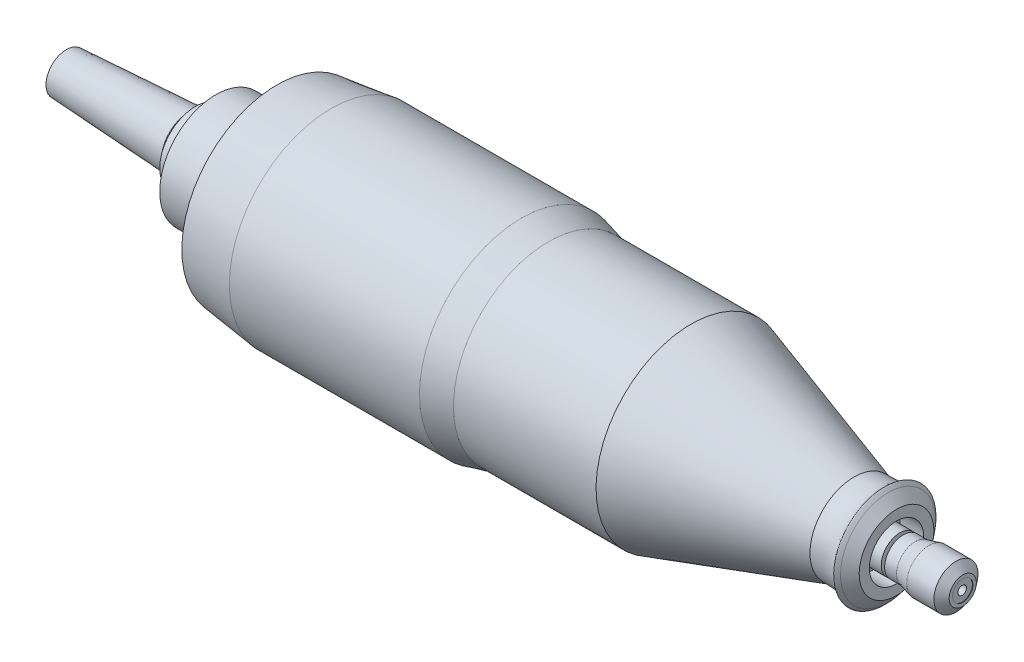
from build123d import *

# Parameters (mm, degrees)
SKETCH2_R          = 1.016
CUT_EXTRUDE1_DEPTH = 2.54


with BuildPart() as part:
    # Sketch1 → Revolve1 (revolve)
    with BuildSketch(Plane.XY, mode=Mode.PRIVATE) as revolve1_sk:
        with BuildLine():
            Line((-6.336100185, 4.7625), (-6.336100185, 0))
            Line((-6.336100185, 0), (203.086165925, 0))
            Line((203.086165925, 0), (203.086165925, 2.38125))
            Line((203.086165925, 2.38125), (203.213899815, 2.38125))
            Line((203.213899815, 2.38125), (203.213899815, 3.175))
            Line((203.213899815, 3.175), (201.626399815, 5.159375))
            Line((201.626399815, 5.159375), (195.276399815, 5.159375))
            Line((195.276399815, 5.159375), (192.101399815, 4.365625))
            Line((192.101399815, 4.365625), (189.323274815, 4.365625))
            Line((189.323274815, 4.365625), (189.323274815, 3.175))
            Line((189.323274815, 3.175), (188.529524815, 3.175))
            Line((188.529524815, 3.175), (188.529524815, 4.365625))
            Line((188.529524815, 4.365625), (182.179524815, 4.365625))
            Line((182.179524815, 4.365625), (182.179524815, 6.35))
            Line((182.179524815, 6.35), (187.735774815, 6.35))
            Line((187.735774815, 6.35), (187.735774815, 8.73125))
            Line((187.735774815, 8.73125), (185.751399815, 11.1125))
            add(Edge.make_bspline(
                [(185.751399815, 11.1125), (184.596565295, 12.439741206), (185.538095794, 11.738561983), (182.922682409, 10.425757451), (181.187370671, 10.372647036), (177.813899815, 10.31875)],
                knots=[0, 0, 0, 0, 0.659544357, 0.859883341, 1, 1, 1, 1], degree=3))
            Line((177.813899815, 10.31875), (139.713899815, 22.225))
            Line((139.713899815, 22.225), (106.376399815, 22.225))
            Line((106.376399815, 22.225), (100.026399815, 23.8125))
            Line((100.026399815, 23.8125), (55.576399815, 23.8125))
            Line((55.576399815, 23.8125), (42.876399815, 22.225))
            Line((42.876399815, 22.225), (36.526399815, 13.096875))
            Line((36.526399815, 13.096875), (28.588899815, 13.096875))
            Line((28.588899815, 13.096875), (28.588899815, 8.334375))
            Line((28.588899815, 8.334375), (23.826399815, 8.334375))
            Line((23.826399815, 8.334375), (22.238899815, 6.35))
            Line((22.238899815, 6.35), (-6.336100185, 4.7625))
        make_face()
    revolve(revolve1_sk.sketch.rotate(Axis((-6.336100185, 0, 0), (1, 0, 0)), 180), axis=Axis((-6.336100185, 0, 0), (1, 0, 0)))

    # Sketch2 → Cut-Extrude1 (cut)
    with BuildSketch(Plane(origin=(203.086165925, 0, 0), x_dir=(0, 0, -1), z_dir=(1, 0, 0))):
        with Locations(Location((0, 0, 0), (0, 0, 90))):
            Circle(SKETCH2_R)
    extrude(amount=-CUT_EXTRUDE1_DEPTH, mode=Mode.SUBTRACT)


solid = part.part
